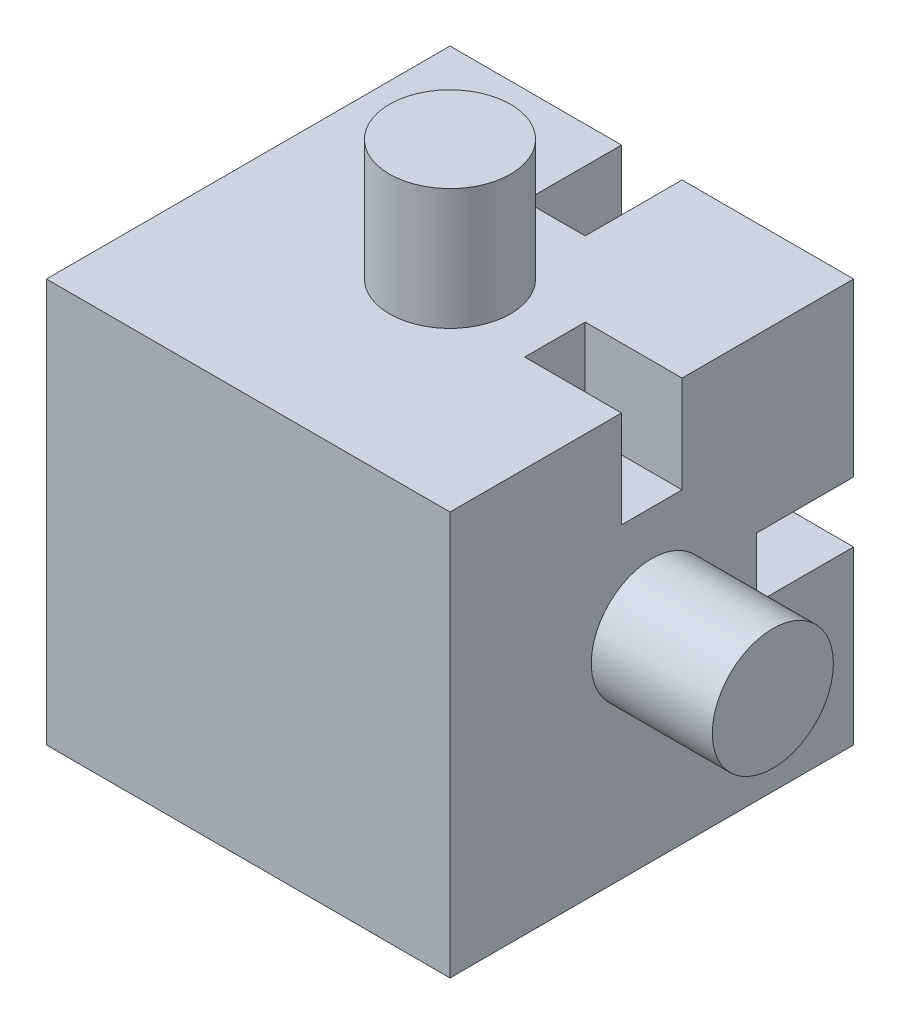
from build123d import *

# Parameters (mm, degrees)
BOSS_EXTRU_1_DEPTH           = 10
BOSS_EXTRU_1_DEPTH_BACK      = 10
ESQUISSE1_W                  = 20
ESQUISSE1_H                  = 20
BOSS_EXTRU_2_START           = -10
ESQUISSE3_R                  = 3
BOSS_EXTRU_2_DEPTH           = 6
BOSS_EXTRU_3_START           = 10
ESQUISSE4_R                  = 3
BOSS_EXTRU_3_DEPTH           = 6
BOSS_EXTRU_4_START           = 10
ESQUISSE5_R                  = 3
BOSS_EXTRU_4_DEPTH           = 6
ENL_V_MAT_EXTRU_1_DEPTH      = 1.5
ENL_V_MAT_EXTRU_1_DEPTH_BACK = 1.5
ESQUISSE6_W                  = 4.8
ESQUISSE6_H                  = 4.8
ENL_V_MAT_EXTRU_2_DEPTH      = 1.5
ENL_V_MAT_EXTRU_2_DEPTH_BACK = 1.5
ESQUISSE7_W                  = 4.8
ESQUISSE7_H                  = 4.8
ENL_V_MAT_EXTRU_3_DEPTH      = 1.5
ENL_V_MAT_EXTRU_3_DEPTH_BACK = 1.5
ESQUISSE8_W                  = 4.8
ESQUISSE8_H                  = 4.8


with BuildPart() as part:
    # Esquisse1 → Boss.-Extru.1 (new, two sides: drawn at the far end of the back side and taken through both)
    with BuildSketch(Plane.XY.offset(-BOSS_EXTRU_1_DEPTH_BACK)):
        Rectangle(ESQUISSE1_W, ESQUISSE1_H)
    extrude(amount=BOSS_EXTRU_1_DEPTH + BOSS_EXTRU_1_DEPTH_BACK)

    # Esquisse3 → Boss.-Extru.2 (add)
    with BuildSketch(Plane.XY.offset(BOSS_EXTRU_2_START)):
        with Locations(Location((0, 0, 0), (0, 0, 180))):
            Circle(ESQUISSE3_R)
    extrude(amount=-BOSS_EXTRU_2_DEPTH)

    # Esquisse4 → Boss.-Extru.3 (add)
    with BuildSketch(Plane(origin=(0, 0, 0), x_dir=(1, 0, 0), z_dir=(0, 1, 0)).offset(BOSS_EXTRU_3_START)):
        with Locations(Location((0, 0, 0), (0, 0, 270))):
            Circle(ESQUISSE4_R)
    extrude(amount=BOSS_EXTRU_3_DEPTH)

    # Esquisse5 → Boss.-Extru.4 (add)
    with BuildSketch(Plane(origin=(0, 0, 0), x_dir=(0, 0, -1), z_dir=(1, 0, 0)).offset(BOSS_EXTRU_4_START)):
        Circle(ESQUISSE5_R)
    extrude(amount=BOSS_EXTRU_4_DEPTH)

    # Esquisse6 → Enl_v. mat.-Extru.1 (cut, two sides: drawn at the far end of the back side and taken through both)
    with BuildSketch(Plane.XY.offset(-ENL_V_MAT_EXTRU_1_DEPTH_BACK)):
        with Locations((7.6, 7.6)):
            Rectangle(ESQUISSE6_W, ESQUISSE6_H)
    extrude(amount=ENL_V_MAT_EXTRU_1_DEPTH + ENL_V_MAT_EXTRU_1_DEPTH_BACK, mode=Mode.SUBTRACT)

    # Esquisse7 → Enl_v. mat.-Extru.2 (cut, two sides: drawn at the far end of the back side and taken through both)
    with BuildSketch(Plane(origin=(0, 0, 0), x_dir=(1, 0, 0), z_dir=(0, 1, 0)).offset(-ENL_V_MAT_EXTRU_2_DEPTH_BACK)):
        with Locations((7.6, 7.6)):
            Rectangle(ESQUISSE7_W, ESQUISSE7_H)
    extrude(amount=ENL_V_MAT_EXTRU_2_DEPTH + ENL_V_MAT_EXTRU_2_DEPTH_BACK, mode=Mode.SUBTRACT)

    # Esquisse8 → Enl_v. mat.-Extru.3 (cut, two sides: drawn at the far end of the back side and taken through both)
    with BuildSketch(Plane(origin=(0, 0, 0), x_dir=(0, 0, -1), z_dir=(1, 0, 0)).offset(-ENL_V_MAT_EXTRU_3_DEPTH_BACK)):
        with Locations((7.6, 7.6)):
            Rectangle(ESQUISSE8_W, ESQUISSE8_H)
    extrude(amount=ENL_V_MAT_EXTRU_3_DEPTH + ENL_V_MAT_EXTRU_3_DEPTH_BACK, mode=Mode.SUBTRACT)


solid = part.part
